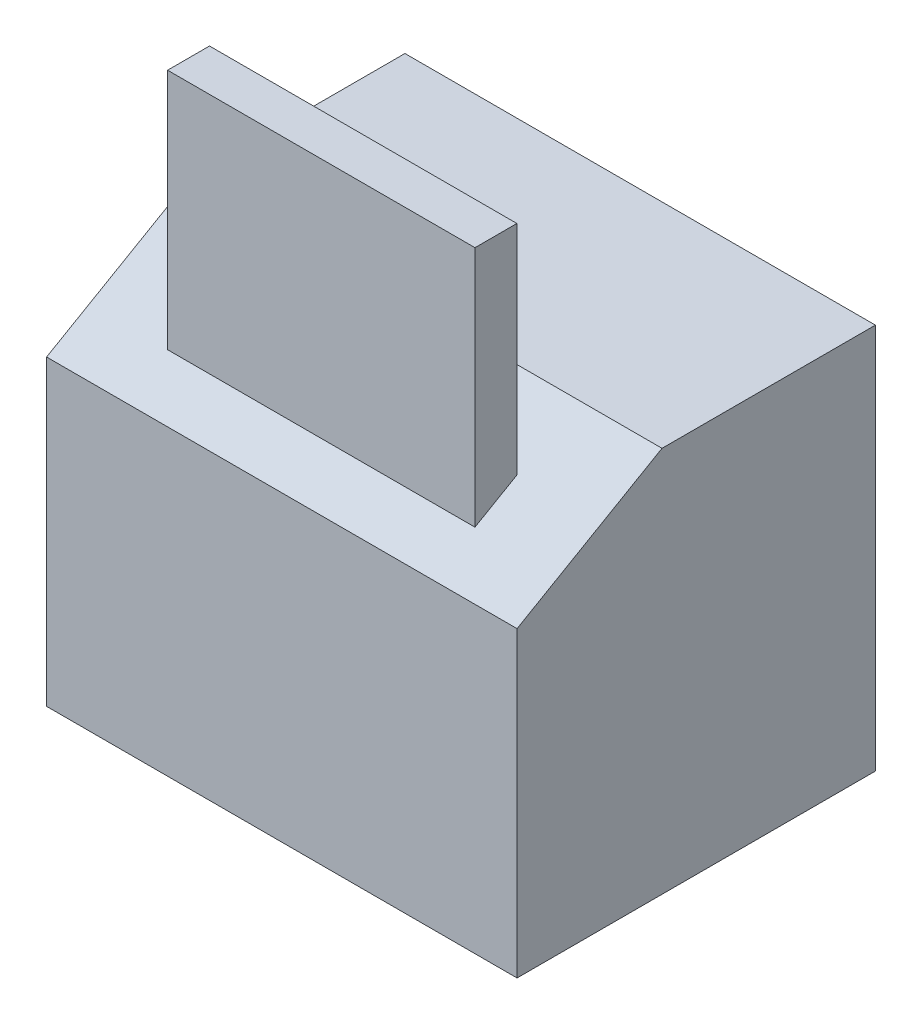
ISO-10303-21;
HEADER;
FILE_DESCRIPTION(('STEP AP214'),'2;1');
FILE_NAME('part.step','',(''),(''),'','','');
FILE_SCHEMA(('AUTOMOTIVE_DESIGN { 1 0 10303 214 1 1 1 1 }'));
ENDSEC;
DATA;
#1=APPLICATION_CONTEXT('core data for automotive mechanical design processes');
#2=APPLICATION_PROTOCOL_DEFINITION('international standard','automotive_design',2000,#1);
#3=PRODUCT_CONTEXT('',#1,'mechanical');
#4=PRODUCT('Part','Part','',(#3));
#5=PRODUCT_RELATED_PRODUCT_CATEGORY('part','',(#4));
#6=PRODUCT_DEFINITION_FORMATION('','',#4);
#7=PRODUCT_DEFINITION_CONTEXT('part definition',#1,'design');
#8=PRODUCT_DEFINITION('design','',#6,#7);
#9=PRODUCT_DEFINITION_SHAPE('','',#8);
#10=(LENGTH_UNIT() NAMED_UNIT(*) SI_UNIT(.MILLI.,.METRE.));
#11=(NAMED_UNIT(*) PLANE_ANGLE_UNIT() SI_UNIT($,.RADIAN.));
#12=(NAMED_UNIT(*) SI_UNIT($,.STERADIAN.) SOLID_ANGLE_UNIT());
#13=UNCERTAINTY_MEASURE_WITH_UNIT(LENGTH_MEASURE(1.E-05),#10,'distance_accuracy_value','');
#14=(GEOMETRIC_REPRESENTATION_CONTEXT(3) GLOBAL_UNCERTAINTY_ASSIGNED_CONTEXT((#13)) GLOBAL_UNIT_ASSIGNED_CONTEXT((#10,
#11,#12)) REPRESENTATION_CONTEXT('',''));
#15=CARTESIAN_POINT('',(0.,0.,0.));
#16=DIRECTION('',(0.,0.,1.));
#17=DIRECTION('',(1.,0.,0.));
#18=AXIS2_PLACEMENT_3D('',#15,#16,#17);
#19=CARTESIAN_POINT('',(-45.9254733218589,76.2,36.3075731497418));
#20=DIRECTION('',(0.,1.,0.));
#21=DIRECTION('',(0.,0.,1.));
#22=AXIS2_PLACEMENT_3D('',#19,#20,#21);
#23=PLANE('',#22);
#24=DIRECTION('',(0.,0.,1.));
#25=VECTOR('',#24,1.);
#26=CARTESIAN_POINT('',(-45.9254733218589,76.2,-34.3839931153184));
#27=LINE('',#26,#25);
#28=CARTESIAN_POINT('',(-45.9254733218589,76.2,-34.3839931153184));
#29=VERTEX_POINT('',#28);
#30=CARTESIAN_POINT('',(-45.9254733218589,76.2,7.71141431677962));
#31=VERTEX_POINT('',#30);
#32=EDGE_CURVE('E116',#29,#31,#27,.T.);
#33=ORIENTED_EDGE('',*,*,#32,.T.);
#34=DIRECTION('',(1.,0.,0.));
#35=VECTOR('',#34,1.);
#36=CARTESIAN_POINT('',(46.8872633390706,76.2,7.71141431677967));
#37=LINE('',#36,#35);
#38=CARTESIAN_POINT('',(46.8872633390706,76.2,7.71141431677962));
#39=VERTEX_POINT('',#38);
#40=EDGE_CURVE('E107',#31,#39,#37,.T.);
#41=ORIENTED_EDGE('',*,*,#40,.T.);
#42=DIRECTION('',(0.,0.,-1.));
#43=VECTOR('',#42,1.);
#44=CARTESIAN_POINT('',(46.8872633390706,76.2,-34.3839931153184));
#45=LINE('',#44,#43);
#46=CARTESIAN_POINT('',(46.8872633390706,76.2,-34.3839931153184));
#47=VERTEX_POINT('',#46);
#48=EDGE_CURVE('E113',#39,#47,#45,.T.);
#49=ORIENTED_EDGE('',*,*,#48,.T.);
#50=DIRECTION('',(-1.,0.,0.));
#51=VECTOR('',#50,1.);
#52=CARTESIAN_POINT('',(-45.9254733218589,76.2,-34.3839931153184));
#53=LINE('',#52,#51);
#54=EDGE_CURVE('E123',#47,#29,#53,.T.);
#55=ORIENTED_EDGE('',*,*,#54,.T.);
#56=EDGE_LOOP('',(#33,#41,#49,#55));
#57=FACE_BOUND('',#56,.T.);
#58=ADVANCED_FACE('F27',(#57),#23,.T.);
#59=CARTESIAN_POINT('',(-45.9254733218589,76.2,-34.3839931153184));
#60=DIRECTION('',(1.,0.,0.));
#61=DIRECTION('',(0.,0.,-1.));
#62=AXIS2_PLACEMENT_3D('',#59,#60,#61);
#63=PLANE('',#62);
#64=DIRECTION('',(0.,-1.,0.));
#65=VECTOR('',#64,1.);
#66=CARTESIAN_POINT('',(-45.9254733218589,76.2,36.3075731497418));
#67=LINE('',#66,#65);
#68=CARTESIAN_POINT('',(-45.9254733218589,59.69,36.3075731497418));
#69=VERTEX_POINT('',#68);
#70=CARTESIAN_POINT('',(-45.9254733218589,0.,36.3075731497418));
#71=VERTEX_POINT('',#70);
#72=EDGE_CURVE('E117',#69,#71,#67,.T.);
#73=ORIENTED_EDGE('',*,*,#72,.F.);
#74=DIRECTION('',(0.,0.500000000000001,-0.866025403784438));
#75=VECTOR('',#74,1.);
#76=CARTESIAN_POINT('',(-45.9254733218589,76.2,7.71141431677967));
#77=LINE('',#76,#75);
#78=EDGE_CURVE('E11',#69,#31,#77,.T.);
#79=ORIENTED_EDGE('',*,*,#78,.T.);
#80=ORIENTED_EDGE('',*,*,#32,.F.);
#81=DIRECTION('',(0.,-1.,0.));
#82=VECTOR('',#81,1.);
#83=CARTESIAN_POINT('',(-45.9254733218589,76.2,-34.3839931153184));
#84=LINE('',#83,#82);
#85=CARTESIAN_POINT('',(-45.9254733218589,0.,-34.3839931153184));
#86=VERTEX_POINT('',#85);
#87=EDGE_CURVE('E125',#29,#86,#84,.T.);
#88=ORIENTED_EDGE('',*,*,#87,.T.);
#89=DIRECTION('',(0.,0.,1.));
#90=VECTOR('',#89,1.);
#91=CARTESIAN_POINT('',(-45.9254733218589,0.,-34.3839931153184));
#92=LINE('',#91,#90);
#93=EDGE_CURVE('E162',#86,#71,#92,.T.);
#94=ORIENTED_EDGE('',*,*,#93,.T.);
#95=EDGE_LOOP('',(#73,#79,#80,#88,#94));
#96=FACE_BOUND('',#95,.T.);
#97=ADVANCED_FACE('F177',(#96),#63,.F.);
#98=CARTESIAN_POINT('',(-45.9254733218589,76.2,36.3075731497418));
#99=DIRECTION('',(0.,0.,-1.));
#100=DIRECTION('',(-1.,0.,0.));
#101=AXIS2_PLACEMENT_3D('',#98,#99,#100);
#102=PLANE('',#101);
#103=DIRECTION('',(0.,-1.,0.));
#104=VECTOR('',#103,1.);
#105=CARTESIAN_POINT('',(46.8872633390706,76.2,36.3075731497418));
#106=LINE('',#105,#104);
#107=CARTESIAN_POINT('',(46.8872633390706,59.69,36.3075731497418));
#108=VERTEX_POINT('',#107);
#109=CARTESIAN_POINT('',(46.8872633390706,0.,36.3075731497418));
#110=VERTEX_POINT('',#109);
#111=EDGE_CURVE('E134',#108,#110,#106,.T.);
#112=ORIENTED_EDGE('',*,*,#111,.F.);
#113=DIRECTION('',(-1.,0.,0.));
#114=VECTOR('',#113,1.);
#115=CARTESIAN_POINT('',(-45.9254733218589,59.69,36.3075731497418));
#116=LINE('',#115,#114);
#117=EDGE_CURVE('E37',#108,#69,#116,.T.);
#118=ORIENTED_EDGE('',*,*,#117,.T.);
#119=ORIENTED_EDGE('',*,*,#72,.T.);
#120=DIRECTION('',(1.,0.,0.));
#121=VECTOR('',#120,1.);
#122=CARTESIAN_POINT('',(-45.9254733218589,0.,36.3075731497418));
#123=LINE('',#122,#121);
#124=EDGE_CURVE('E165',#71,#110,#123,.T.);
#125=ORIENTED_EDGE('',*,*,#124,.T.);
#126=EDGE_LOOP('',(#112,#118,#119,#125));
#127=FACE_BOUND('',#126,.T.);
#128=ADVANCED_FACE('F180',(#127),#102,.F.);
#129=CARTESIAN_POINT('',(46.8872633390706,76.2,-34.3839931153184));
#130=DIRECTION('',(-1.,0.,0.));
#131=DIRECTION('',(0.,0.,1.));
#132=AXIS2_PLACEMENT_3D('',#129,#130,#131);
#133=PLANE('',#132);
#134=ORIENTED_EDGE('',*,*,#48,.F.);
#135=DIRECTION('',(0.,-0.500000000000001,0.866025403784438));
#136=VECTOR('',#135,1.);
#137=CARTESIAN_POINT('',(46.8872633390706,76.2,7.71141431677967));
#138=LINE('',#137,#136);
#139=EDGE_CURVE('E103',#39,#108,#138,.T.);
#140=ORIENTED_EDGE('',*,*,#139,.T.);
#141=ORIENTED_EDGE('',*,*,#111,.T.);
#142=DIRECTION('',(0.,0.,-1.));
#143=VECTOR('',#142,1.);
#144=CARTESIAN_POINT('',(46.8872633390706,0.,-34.3839931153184));
#145=LINE('',#144,#143);
#146=CARTESIAN_POINT('',(46.8872633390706,0.,-34.3839931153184));
#147=VERTEX_POINT('',#146);
#148=EDGE_CURVE('E168',#110,#147,#145,.T.);
#149=ORIENTED_EDGE('',*,*,#148,.T.);
#150=DIRECTION('',(0.,-1.,0.));
#151=VECTOR('',#150,1.);
#152=CARTESIAN_POINT('',(46.8872633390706,76.2,-34.3839931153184));
#153=LINE('',#152,#151);
#154=EDGE_CURVE('E121',#47,#147,#153,.T.);
#155=ORIENTED_EDGE('',*,*,#154,.F.);
#156=EDGE_LOOP('',(#134,#140,#141,#149,#155));
#157=FACE_BOUND('',#156,.T.);
#158=ADVANCED_FACE('F119',(#157),#133,.F.);
#159=CARTESIAN_POINT('',(-45.9254733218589,76.2,-34.3839931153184));
#160=DIRECTION('',(0.,0.,1.));
#161=DIRECTION('',(1.,0.,0.));
#162=AXIS2_PLACEMENT_3D('',#159,#160,#161);
#163=PLANE('',#162);
#164=DIRECTION('',(-1.,0.,0.));
#165=VECTOR('',#164,1.);
#166=CARTESIAN_POINT('',(-45.9254733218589,0.,-34.3839931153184));
#167=LINE('',#166,#165);
#168=EDGE_CURVE('E127',#147,#86,#167,.T.);
#169=ORIENTED_EDGE('',*,*,#168,.T.);
#170=ORIENTED_EDGE('',*,*,#87,.F.);
#171=ORIENTED_EDGE('',*,*,#54,.F.);
#172=ORIENTED_EDGE('',*,*,#154,.T.);
#173=EDGE_LOOP('',(#169,#170,#171,#172));
#174=FACE_BOUND('',#173,.T.);
#175=ADVANCED_FACE('F172',(#174),#163,.F.);
#176=CARTESIAN_POINT('',(-45.9254733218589,0.,36.3075731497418));
#177=DIRECTION('',(0.,1.,0.));
#178=DIRECTION('',(0.,0.,1.));
#179=AXIS2_PLACEMENT_3D('',#176,#177,#178);
#180=PLANE('',#179);
#181=ORIENTED_EDGE('',*,*,#93,.F.);
#182=ORIENTED_EDGE('',*,*,#168,.F.);
#183=ORIENTED_EDGE('',*,*,#148,.F.);
#184=ORIENTED_EDGE('',*,*,#124,.F.);
#185=EDGE_LOOP('',(#181,#182,#183,#184));
#186=FACE_BOUND('',#185,.T.);
#187=ADVANCED_FACE('F179',(#186),#180,.F.);
#188=CARTESIAN_POINT('',(30.2271615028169,112.268,27.9516457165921));
#189=DIRECTION('',(-1.,0.,0.));
#190=DIRECTION('',(0.,0.,1.));
#191=AXIS2_PLACEMENT_3D('',#188,#189,#190);
#192=PLANE('',#191);
#193=DIRECTION('',(0.,0.500000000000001,-0.866025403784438));
#194=VECTOR('',#193,1.);
#195=CARTESIAN_POINT('',(30.2271615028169,76.4527227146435,7.27368573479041));
#196=LINE('',#195,#194);
#197=CARTESIAN_POINT('',(30.2271615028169,64.5142969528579,27.9516457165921));
#198=VERTEX_POINT('',#197);
#199=CARTESIAN_POINT('',(30.2271615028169,69.2885404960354,19.6824133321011));
#200=VERTEX_POINT('',#199);
#201=EDGE_CURVE('E31',#198,#200,#196,.T.);
#202=ORIENTED_EDGE('',*,*,#201,.T.);
#203=DIRECTION('',(0.,-1.,0.));
#204=VECTOR('',#203,1.);
#205=CARTESIAN_POINT('',(30.2271615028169,112.268,19.6824133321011));
#206=LINE('',#205,#204);
#207=CARTESIAN_POINT('',(30.2271615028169,112.268,19.6824133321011));
#208=VERTEX_POINT('',#207);
#209=EDGE_CURVE('E160',#208,#200,#206,.T.);
#210=ORIENTED_EDGE('',*,*,#209,.F.);
#211=DIRECTION('',(0.,0.,-1.));
#212=VECTOR('',#211,1.);
#213=CARTESIAN_POINT('',(30.2271615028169,112.268,27.9516457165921));
#214=LINE('',#213,#212);
#215=CARTESIAN_POINT('',(30.2271615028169,112.268,27.9516457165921));
#216=VERTEX_POINT('',#215);
#217=EDGE_CURVE('E142',#216,#208,#214,.T.);
#218=ORIENTED_EDGE('',*,*,#217,.F.);
#219=DIRECTION('',(0.,-1.,0.));
#220=VECTOR('',#219,1.);
#221=CARTESIAN_POINT('',(30.2271615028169,112.268,27.9516457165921));
#222=LINE('',#221,#220);
#223=EDGE_CURVE('E153',#216,#198,#222,.T.);
#224=ORIENTED_EDGE('',*,*,#223,.T.);
#225=EDGE_LOOP('',(#202,#210,#218,#224));
#226=FACE_BOUND('',#225,.T.);
#227=ADVANCED_FACE('F200',(#226),#192,.F.);
#228=CARTESIAN_POINT('',(30.2271615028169,112.268,19.6824133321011));
#229=DIRECTION('',(0.,0.,1.));
#230=DIRECTION('',(1.,0.,0.));
#231=AXIS2_PLACEMENT_3D('',#228,#229,#230);
#232=PLANE('',#231);
#233=DIRECTION('',(-1.,0.,0.));
#234=VECTOR('',#233,1.);
#235=CARTESIAN_POINT('',(30.2271615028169,69.2885404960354,19.6824133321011));
#236=LINE('',#235,#234);
#237=CARTESIAN_POINT('',(-30.4138759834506,69.2885404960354,19.6824133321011));
#238=VERTEX_POINT('',#237);
#239=EDGE_CURVE('E138',#200,#238,#236,.T.);
#240=ORIENTED_EDGE('',*,*,#239,.T.);
#241=DIRECTION('',(0.,-1.,0.));
#242=VECTOR('',#241,1.);
#243=CARTESIAN_POINT('',(-30.4138759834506,112.268,19.6824133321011));
#244=LINE('',#243,#242);
#245=CARTESIAN_POINT('',(-30.4138759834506,112.268,19.6824133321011));
#246=VERTEX_POINT('',#245);
#247=EDGE_CURVE('E157',#246,#238,#244,.T.);
#248=ORIENTED_EDGE('',*,*,#247,.F.);
#249=DIRECTION('',(-1.,0.,0.));
#250=VECTOR('',#249,1.);
#251=CARTESIAN_POINT('',(30.2271615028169,112.268,19.6824133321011));
#252=LINE('',#251,#250);
#253=EDGE_CURVE('E74',#208,#246,#252,.T.);
#254=ORIENTED_EDGE('',*,*,#253,.F.);
#255=ORIENTED_EDGE('',*,*,#209,.T.);
#256=EDGE_LOOP('',(#240,#248,#254,#255));
#257=FACE_BOUND('',#256,.T.);
#258=ADVANCED_FACE('F204',(#257),#232,.F.);
#259=CARTESIAN_POINT('',(-30.4138759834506,112.268,27.9516457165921));
#260=DIRECTION('',(1.,0.,0.));
#261=DIRECTION('',(0.,0.,-1.));
#262=AXIS2_PLACEMENT_3D('',#259,#260,#261);
#263=PLANE('',#262);
#264=DIRECTION('',(0.,-0.500000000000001,0.866025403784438));
#265=VECTOR('',#264,1.);
#266=CARTESIAN_POINT('',(-30.4138759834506,76.4527227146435,7.27368573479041));
#267=LINE('',#266,#265);
#268=CARTESIAN_POINT('',(-30.4138759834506,64.5142969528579,27.9516457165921));
#269=VERTEX_POINT('',#268);
#270=EDGE_CURVE('E140',#238,#269,#267,.T.);
#271=ORIENTED_EDGE('',*,*,#270,.T.);
#272=DIRECTION('',(0.,-1.,0.));
#273=VECTOR('',#272,1.);
#274=CARTESIAN_POINT('',(-30.4138759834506,112.268,27.9516457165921));
#275=LINE('',#274,#273);
#276=CARTESIAN_POINT('',(-30.4138759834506,112.268,27.9516457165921));
#277=VERTEX_POINT('',#276);
#278=EDGE_CURVE('E155',#277,#269,#275,.T.);
#279=ORIENTED_EDGE('',*,*,#278,.F.);
#280=DIRECTION('',(0.,0.,1.));
#281=VECTOR('',#280,1.);
#282=CARTESIAN_POINT('',(-30.4138759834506,112.268,27.9516457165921));
#283=LINE('',#282,#281);
#284=EDGE_CURVE('E147',#246,#277,#283,.T.);
#285=ORIENTED_EDGE('',*,*,#284,.F.);
#286=ORIENTED_EDGE('',*,*,#247,.T.);
#287=EDGE_LOOP('',(#271,#279,#285,#286));
#288=FACE_BOUND('',#287,.T.);
#289=ADVANCED_FACE('F209',(#288),#263,.F.);
#290=CARTESIAN_POINT('',(30.2271615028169,112.268,27.9516457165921));
#291=DIRECTION('',(0.,0.,-1.));
#292=DIRECTION('',(-1.,0.,0.));
#293=AXIS2_PLACEMENT_3D('',#290,#291,#292);
#294=PLANE('',#293);
#295=DIRECTION('',(1.,0.,0.));
#296=VECTOR('',#295,1.);
#297=CARTESIAN_POINT('',(30.2271615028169,64.5142969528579,27.9516457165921));
#298=LINE('',#297,#296);
#299=EDGE_CURVE('E65',#269,#198,#298,.T.);
#300=ORIENTED_EDGE('',*,*,#299,.T.);
#301=ORIENTED_EDGE('',*,*,#223,.F.);
#302=DIRECTION('',(1.,0.,0.));
#303=VECTOR('',#302,1.);
#304=CARTESIAN_POINT('',(30.2271615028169,112.268,27.9516457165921));
#305=LINE('',#304,#303);
#306=EDGE_CURVE('E151',#277,#216,#305,.T.);
#307=ORIENTED_EDGE('',*,*,#306,.F.);
#308=ORIENTED_EDGE('',*,*,#278,.T.);
#309=EDGE_LOOP('',(#300,#301,#307,#308));
#310=FACE_BOUND('',#309,.T.);
#311=ADVANCED_FACE('F215',(#310),#294,.F.);
#312=CARTESIAN_POINT('',(30.2271615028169,112.268,19.6824133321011));
#313=DIRECTION('',(0.,1.,0.));
#314=DIRECTION('',(0.,0.,1.));
#315=AXIS2_PLACEMENT_3D('',#312,#313,#314);
#316=PLANE('',#315);
#317=ORIENTED_EDGE('',*,*,#217,.T.);
#318=ORIENTED_EDGE('',*,*,#253,.T.);
#319=ORIENTED_EDGE('',*,*,#284,.T.);
#320=ORIENTED_EDGE('',*,*,#306,.T.);
#321=EDGE_LOOP('',(#317,#318,#319,#320));
#322=FACE_BOUND('',#321,.T.);
#323=ADVANCED_FACE('F219',(#322),#316,.T.);
#324=CARTESIAN_POINT('',(-45.9254733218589,76.2,7.71141431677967));
#325=DIRECTION('',(0.,0.866025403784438,0.500000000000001));
#326=DIRECTION('',(0.,-0.500000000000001,0.866025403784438));
#327=AXIS2_PLACEMENT_3D('',#324,#325,#326);
#328=PLANE('',#327);
#329=ORIENTED_EDGE('',*,*,#78,.F.);
#330=ORIENTED_EDGE('',*,*,#117,.F.);
#331=ORIENTED_EDGE('',*,*,#139,.F.);
#332=ORIENTED_EDGE('',*,*,#40,.F.);
#333=EDGE_LOOP('',(#329,#330,#331,#332));
#334=FACE_BOUND('',#333,.T.);
#335=ORIENTED_EDGE('',*,*,#239,.F.);
#336=ORIENTED_EDGE('',*,*,#201,.F.);
#337=ORIENTED_EDGE('',*,*,#299,.F.);
#338=ORIENTED_EDGE('',*,*,#270,.F.);
#339=EDGE_LOOP('',(#335,#336,#337,#338));
#340=FACE_BOUND('',#339,.T.);
#341=ADVANCED_FACE('F29',(#334,#340),#328,.T.);
#342=CLOSED_SHELL('',(#58,#97,#128,#158,#175,#187,#227,#258,#289,#311,#323,#341));
#343=MANIFOLD_SOLID_BREP('B2',#342);
#344=ADVANCED_BREP_SHAPE_REPRESENTATION('',(#18,#343),#14);
#345=SHAPE_DEFINITION_REPRESENTATION(#9,#344);
ENDSEC;
END-ISO-10303-21;
